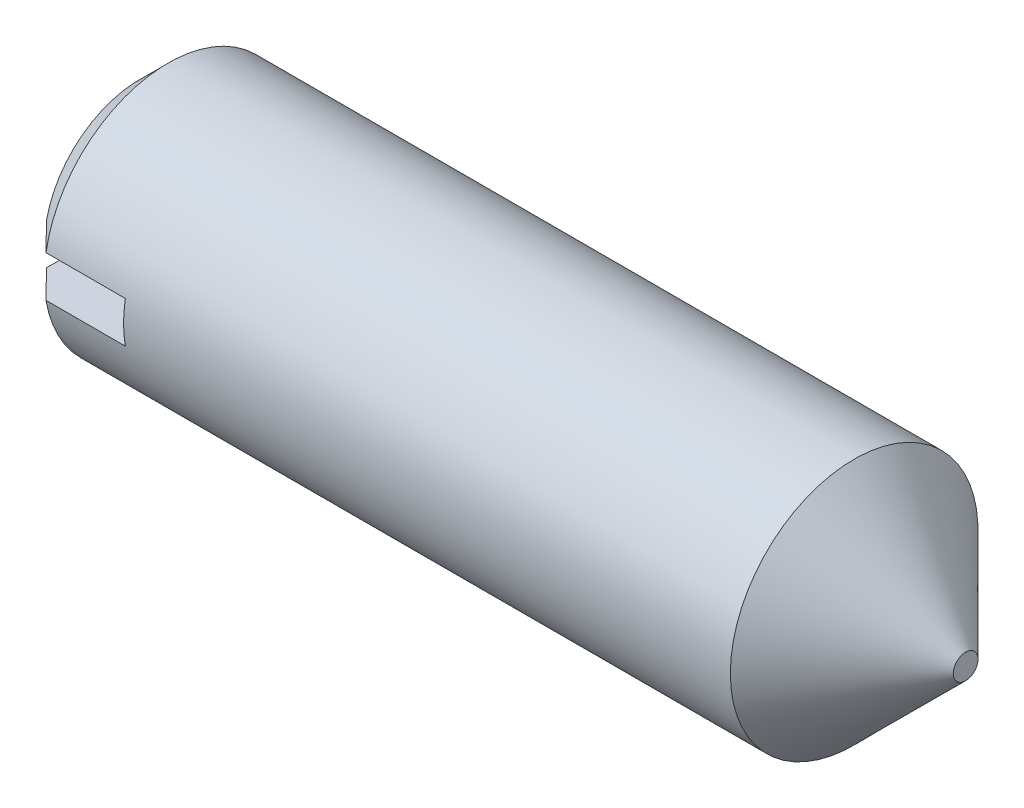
ISO-10303-21;
HEADER;
FILE_DESCRIPTION(('STEP AP214'),'2;1');
FILE_NAME('part.step','',(''),(''),'','','');
FILE_SCHEMA(('AUTOMOTIVE_DESIGN { 1 0 10303 214 1 1 1 1 }'));
ENDSEC;
DATA;
#1=APPLICATION_CONTEXT('core data for automotive mechanical design processes');
#2=APPLICATION_PROTOCOL_DEFINITION('international standard','automotive_design',2000,#1);
#3=PRODUCT_CONTEXT('',#1,'mechanical');
#4=PRODUCT('Part','Part','',(#3));
#5=PRODUCT_RELATED_PRODUCT_CATEGORY('part','',(#4));
#6=PRODUCT_DEFINITION_FORMATION('','',#4);
#7=PRODUCT_DEFINITION_CONTEXT('part definition',#1,'design');
#8=PRODUCT_DEFINITION('design','',#6,#7);
#9=PRODUCT_DEFINITION_SHAPE('','',#8);
#10=(LENGTH_UNIT() NAMED_UNIT(*) SI_UNIT(.MILLI.,.METRE.));
#11=(NAMED_UNIT(*) PLANE_ANGLE_UNIT() SI_UNIT($,.RADIAN.));
#12=(NAMED_UNIT(*) SI_UNIT($,.STERADIAN.) SOLID_ANGLE_UNIT());
#13=UNCERTAINTY_MEASURE_WITH_UNIT(LENGTH_MEASURE(1.E-05),#10,'distance_accuracy_value','');
#14=(GEOMETRIC_REPRESENTATION_CONTEXT(3) GLOBAL_UNCERTAINTY_ASSIGNED_CONTEXT((#13)) GLOBAL_UNIT_ASSIGNED_CONTEXT((#10,
#11,#12)) REPRESENTATION_CONTEXT('',''));
#15=CARTESIAN_POINT('',(0.,0.,0.));
#16=DIRECTION('',(0.,0.,1.));
#17=DIRECTION('',(1.,0.,0.));
#18=AXIS2_PLACEMENT_3D('',#15,#16,#17);
#19=CARTESIAN_POINT('',(0.,0.4645,0.));
#20=DIRECTION('',(1.,0.,0.));
#21=DIRECTION('',(0.,0.,-1.));
#22=AXIS2_PLACEMENT_3D('',#19,#20,#21);
#23=PLANE('',#22);
#24=CARTESIAN_POINT('',(0.,0.,0.));
#25=DIRECTION('',(-1.,0.,0.));
#26=DIRECTION('',(0.,0.,1.));
#27=AXIS2_PLACEMENT_3D('',#24,#25,#26);
#28=CIRCLE('',#27,0.4645);
#29=CARTESIAN_POINT('',(0.,0.1,0.453608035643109));
#30=VERTEX_POINT('',#29);
#31=CARTESIAN_POINT('',(0.,0.1,-0.453608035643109));
#32=VERTEX_POINT('',#31);
#33=EDGE_CURVE('E113',#30,#32,#28,.T.);
#34=ORIENTED_EDGE('',*,*,#33,.T.);
#35=DIRECTION('',(0.,0.,1.));
#36=VECTOR('',#35,1.);
#37=CARTESIAN_POINT('',(0.,0.1,-0.6));
#38=LINE('',#37,#36);
#39=EDGE_CURVE('E100',#32,#30,#38,.T.);
#40=ORIENTED_EDGE('',*,*,#39,.T.);
#41=EDGE_LOOP('',(#34,#40));
#42=FACE_BOUND('',#41,.T.);
#43=ADVANCED_FACE('F30',(#42),#23,.F.);
#44=CARTESIAN_POINT('',(0.1355,0.,0.));
#45=DIRECTION('',(1.,0.,0.));
#46=DIRECTION('',(0.,0.,-1.));
#47=AXIS2_PLACEMENT_3D('',#44,#45,#46);
#48=CONICAL_SURFACE('',#47,0.6,0.785398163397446);
#49=CARTESIAN_POINT('',(0.1355,0.,0.));
#50=DIRECTION('',(-1.,0.,0.));
#51=DIRECTION('',(0.,0.,1.));
#52=AXIS2_PLACEMENT_3D('',#49,#50,#51);
#53=CIRCLE('',#52,0.6);
#54=CARTESIAN_POINT('',(0.135500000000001,0.1,0.591607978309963));
#55=VERTEX_POINT('',#54);
#56=CARTESIAN_POINT('',(0.135500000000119,0.1,-0.591607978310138));
#57=VERTEX_POINT('',#56);
#58=EDGE_CURVE('E117',#55,#57,#53,.T.);
#59=ORIENTED_EDGE('',*,*,#58,.T.);
#60=CARTESIAN_POINT('',(0.860275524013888,0.1,-1.32099590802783));
#61=CARTESIAN_POINT('',(0.813630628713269,0.1,-1.27421639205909));
#62=CARTESIAN_POINT('',(0.766991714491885,0.1,-1.2274309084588));
#63=CARTESIAN_POINT('',(0.673732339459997,0.1,-1.13383826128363));
#64=CARTESIAN_POINT('',(0.627111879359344,0.1,-1.08703109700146));
#65=CARTESIAN_POINT('',(0.533858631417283,0.1,-0.993347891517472));
#66=CARTESIAN_POINT('',(0.487225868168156,0.1,-0.946471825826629));
#67=CARTESIAN_POINT('',(0.39400585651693,0.1,-0.852677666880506));
#68=CARTESIAN_POINT('',(0.347418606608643,0.1,-0.805759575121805));
#69=CARTESIAN_POINT('',(0.256319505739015,0.1,-0.713873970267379));
#70=CARTESIAN_POINT('',(0.211804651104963,0.1,-0.668909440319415));
#71=CARTESIAN_POINT('',(0.122889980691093,0.1,-0.578858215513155));
#72=CARTESIAN_POINT('',(0.0784901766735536,0.1,-0.533771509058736));
#73=CARTESIAN_POINT('',(-0.010061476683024,0.1,-0.443399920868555));
#74=CARTESIAN_POINT('',(-0.0542134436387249,0.1,-0.398115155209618));
#75=CARTESIAN_POINT('',(-0.11997613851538,0.1,-0.329746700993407));
#76=CARTESIAN_POINT('',(-0.141817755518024,0.1,-0.306885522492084));
#77=CARTESIAN_POINT('',(-0.185210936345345,0.1,-0.260890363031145));
#78=CARTESIAN_POINT('',(-0.206762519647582,0.1,-0.2377564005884));
#79=CARTESIAN_POINT('',(-0.239779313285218,0.1,-0.201318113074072));
#80=CARTESIAN_POINT('',(-0.25146751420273,0.1,-0.188217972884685));
#81=CARTESIAN_POINT('',(-0.274563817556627,0.1,-0.161615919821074));
#82=CARTESIAN_POINT('',(-0.285969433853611,0.1,-0.148111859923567));
#83=CARTESIAN_POINT('',(-0.308194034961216,0.1,-0.120431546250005));
#84=CARTESIAN_POINT('',(-0.319007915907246,0.1,-0.10625097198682));
#85=CARTESIAN_POINT('',(-0.333918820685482,0.1,-0.0841405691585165));
#86=CARTESIAN_POINT('',(-0.338659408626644,0.1,-0.0766525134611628));
#87=CARTESIAN_POINT('',(-0.347399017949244,0.1,-0.0612627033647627));
#88=CARTESIAN_POINT('',(-0.35140000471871,0.1,-0.0533621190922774));
#89=CARTESIAN_POINT('',(-0.357286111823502,0.1,-0.0390602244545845));
#90=CARTESIAN_POINT('',(-0.359450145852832,0.1,-0.0327780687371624));
#91=CARTESIAN_POINT('',(-0.362714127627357,0.1,-0.0199573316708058));
#92=CARTESIAN_POINT('',(-0.363819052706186,0.1,-0.0134201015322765));
#93=CARTESIAN_POINT('',(-0.364718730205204,0.1,-0.000185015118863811));
#94=CARTESIAN_POINT('',(-0.364500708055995,0.1,0.00651378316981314));
#95=CARTESIAN_POINT('',(-0.362781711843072,0.1,0.019753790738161));
#96=CARTESIAN_POINT('',(-0.361276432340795,0.1,0.026294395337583));
#97=CARTESIAN_POINT('',(-0.356320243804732,0.1,0.0422710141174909));
#98=CARTESIAN_POINT('',(-0.352271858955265,0.1,0.0515113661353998));
#99=CARTESIAN_POINT('',(-0.343017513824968,0.1,0.0694045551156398));
#100=CARTESIAN_POINT('',(-0.33780536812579,0.1,0.0780539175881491));
#101=CARTESIAN_POINT('',(-0.325700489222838,0.1,0.0965559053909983));
#102=CARTESIAN_POINT('',(-0.318677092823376,0.1,0.106321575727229));
#103=CARTESIAN_POINT('',(-0.304154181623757,0.1,0.125495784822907));
#104=CARTESIAN_POINT('',(-0.296654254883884,0.1,0.134904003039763));
#105=CARTESIAN_POINT('',(-0.273713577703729,0.1,0.162833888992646));
#106=CARTESIAN_POINT('',(-0.257863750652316,0.1,0.181017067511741));
#107=CARTESIAN_POINT('',(-0.225688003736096,0.1,0.217008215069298));
#108=CARTESIAN_POINT('',(-0.209361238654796,0.1,0.234815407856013));
#109=CARTESIAN_POINT('',(-0.17648614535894,0.1,0.270174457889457));
#110=CARTESIAN_POINT('',(-0.159938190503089,0.1,0.287726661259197));
#111=CARTESIAN_POINT('',(-0.110401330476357,0.1,0.33985926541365));
#112=CARTESIAN_POINT('',(-0.0772126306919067,0.1,0.374248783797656));
#113=CARTESIAN_POINT('',(-0.0106080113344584,0.1,0.44280856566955));
#114=CARTESIAN_POINT('',(0.0228079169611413,0.1,0.476978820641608));
#115=CARTESIAN_POINT('',(0.123273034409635,0.1,0.579358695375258));
#116=CARTESIAN_POINT('',(0.190498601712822,0.1,0.647395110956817));
#117=CARTESIAN_POINT('',(0.324948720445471,0.1,0.783139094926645));
#118=CARTESIAN_POINT('',(0.392172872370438,0.1,0.850847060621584));
#119=CARTESIAN_POINT('',(0.526696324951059,0.1,0.986166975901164));
#120=CARTESIAN_POINT('',(0.593995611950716,0.1,1.0537789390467));
#121=CARTESIAN_POINT('',(0.69445422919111,0.1,1.15463547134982));
#122=CARTESIAN_POINT('',(0.727596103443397,0.1,1.18789745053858));
#123=CARTESIAN_POINT('',(0.793915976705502,0.1,1.25443943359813));
#124=CARTESIAN_POINT('',(0.827093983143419,0.1,1.28771943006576));
#125=CARTESIAN_POINT('',(0.860275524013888,0.1,1.32099590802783));
#126=B_SPLINE_CURVE_WITH_KNOTS('',3,(#60,#61,#62,#63,#64,#65,#66,#67,#68,#69,#70,#71,#72,#73,
#74,#75,#76,#77,#78,#79,#80,#81,#82,#83,#84,#85,#86,#87,#88,#89,#90,#91,#92,#93,#94,#95,#96,#97,
#98,#99,#100,#101,#102,#103,#104,#105,#106,#107,#108,#109,#110,#111,#112,#113,#114,#115,#116,
#117,#118,#119,#120,#121,#122,#123,#124,#125),.UNSPECIFIED.,.F.,.F.,(4,2,2,2,2,2,2,2,2,2,2,2,2,
2,2,2,2,2,2,2,2,2,2,2,2,2,2,2,2,2,2,2,4),(0.,0.198183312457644,0.396373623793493,
0.594736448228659,0.793092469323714,0.982909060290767,1.17274434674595,1.3624802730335,
1.45733297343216,1.55217927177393,1.60484304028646,1.65786982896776,1.71129869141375,
1.73786560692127,1.76436087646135,1.78423031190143,1.80400590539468,1.82397275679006,
1.84400665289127,1.87410246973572,1.90436222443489,1.94041942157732,1.97650822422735,
2.04884773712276,2.12132432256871,2.19369104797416,2.33706610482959,2.48044669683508,
2.7673845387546,3.05362071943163,3.33981136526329,3.48067544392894,3.62165432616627),.UNSPECIFIED.);
#127=EDGE_CURVE('E53',#57,#32,#126,.T.);
#128=ORIENTED_EDGE('',*,*,#127,.T.);
#129=ORIENTED_EDGE('',*,*,#33,.F.);
#130=EDGE_CURVE('E131',#30,#55,#126,.T.);
#131=ORIENTED_EDGE('',*,*,#130,.T.);
#132=EDGE_LOOP('',(#59,#128,#129,#131));
#133=FACE_BOUND('',#132,.T.);
#134=ADVANCED_FACE('F149',(#133),#48,.T.);
#135=CARTESIAN_POINT('',(0.,-0.1,-0.453608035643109));
#136=VERTEX_POINT('',#135);
#137=CARTESIAN_POINT('',(0.,-0.1,0.453608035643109));
#138=VERTEX_POINT('',#137);
#139=EDGE_CURVE('E112',#136,#138,#28,.T.);
#140=ORIENTED_EDGE('',*,*,#139,.T.);
#141=DIRECTION('',(0.,0.,1.));
#142=VECTOR('',#141,1.);
#143=CARTESIAN_POINT('',(0.,-0.1,-0.6));
#144=LINE('',#143,#142);
#145=EDGE_CURVE('E93',#136,#138,#144,.T.);
#146=ORIENTED_EDGE('',*,*,#145,.F.);
#147=EDGE_LOOP('',(#140,#146));
#148=FACE_BOUND('',#147,.T.);
#149=ADVANCED_FACE('F32',(#148),#23,.F.);
#150=CARTESIAN_POINT('',(4.,0.,0.));
#151=DIRECTION('',(-1.,0.,0.));
#152=DIRECTION('',(0.,0.,1.));
#153=AXIS2_PLACEMENT_3D('',#150,#151,#152);
#154=PLANE('',#153);
#155=CARTESIAN_POINT('',(4.,0.,0.));
#156=DIRECTION('',(-1.,0.,0.));
#157=DIRECTION('',(0.,0.,1.));
#158=AXIS2_PLACEMENT_3D('',#155,#156,#157);
#159=CIRCLE('',#158,0.06);
#160=CARTESIAN_POINT('',(4.,0.,0.0599999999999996));
#161=VERTEX_POINT('',#160);
#162=EDGE_CURVE('E121',#161,#161,#159,.T.);
#163=ORIENTED_EDGE('',*,*,#162,.F.);
#164=EDGE_LOOP('',(#163));
#165=FACE_BOUND('',#164,.T.);
#166=ADVANCED_FACE('F156',(#165),#154,.F.);
#167=CARTESIAN_POINT('',(4.,0.,0.));
#168=DIRECTION('',(-1.,0.,0.));
#169=DIRECTION('',(0.,0.,1.));
#170=AXIS2_PLACEMENT_3D('',#167,#168,#169);
#171=CONICAL_SURFACE('',#170,0.06,0.785398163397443);
#172=CARTESIAN_POINT('',(3.45999999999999,0.,0.));
#173=DIRECTION('',(-1.,0.,0.));
#174=DIRECTION('',(0.,0.,1.));
#175=AXIS2_PLACEMENT_3D('',#172,#173,#174);
#176=CIRCLE('',#175,0.6);
#177=CARTESIAN_POINT('',(3.45999999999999,0.,0.6));
#178=VERTEX_POINT('',#177);
#179=EDGE_CURVE('E118',#178,#178,#176,.T.);
#180=CARTESIAN_POINT('',(3.45999999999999,0.,0.6));
#181=CARTESIAN_POINT('',(3.46562499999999,0.,0.594375));
#182=CARTESIAN_POINT('',(3.47124999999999,0.,0.58875));
#183=CARTESIAN_POINT('',(3.48249999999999,0.,0.5775));
#184=CARTESIAN_POINT('',(3.48812499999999,0.,0.571875));
#185=CARTESIAN_POINT('',(3.49937499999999,0.,0.560625));
#186=CARTESIAN_POINT('',(3.50499999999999,0.,0.555));
#187=CARTESIAN_POINT('',(3.51624999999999,0.,0.54375));
#188=CARTESIAN_POINT('',(3.52187499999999,0.,0.538125));
#189=CARTESIAN_POINT('',(3.53312499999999,0.,0.526875));
#190=CARTESIAN_POINT('',(3.53874999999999,0.,0.52125));
#191=CARTESIAN_POINT('',(3.54999999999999,0.,0.51));
#192=CARTESIAN_POINT('',(3.55562499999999,0.,0.504375));
#193=CARTESIAN_POINT('',(3.56687499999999,0.,0.493125));
#194=CARTESIAN_POINT('',(3.57249999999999,0.,0.4875));
#195=CARTESIAN_POINT('',(3.58374999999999,0.,0.47625));
#196=CARTESIAN_POINT('',(3.58937499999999,0.,0.470625));
#197=CARTESIAN_POINT('',(3.60062499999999,0.,0.459375));
#198=CARTESIAN_POINT('',(3.60624999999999,0.,0.45375));
#199=CARTESIAN_POINT('',(3.61749999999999,0.,0.4425));
#200=CARTESIAN_POINT('',(3.623125,0.,0.436875));
#201=CARTESIAN_POINT('',(3.634375,0.,0.425625));
#202=CARTESIAN_POINT('',(3.63999999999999,0.,0.42));
#203=CARTESIAN_POINT('',(3.65124999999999,0.,0.40875));
#204=CARTESIAN_POINT('',(3.65687499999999,0.,0.403125));
#205=CARTESIAN_POINT('',(3.66812499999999,0.,0.391875));
#206=CARTESIAN_POINT('',(3.67375,0.,0.38625));
#207=CARTESIAN_POINT('',(3.685,0.,0.375));
#208=CARTESIAN_POINT('',(3.690625,0.,0.369375));
#209=CARTESIAN_POINT('',(3.701875,0.,0.358125));
#210=CARTESIAN_POINT('',(3.7075,0.,0.3525));
#211=CARTESIAN_POINT('',(3.71875,0.,0.34125));
#212=CARTESIAN_POINT('',(3.724375,0.,0.335625));
#213=CARTESIAN_POINT('',(3.735625,0.,0.324375));
#214=CARTESIAN_POINT('',(3.74125,0.,0.31875));
#215=CARTESIAN_POINT('',(3.7525,0.,0.3075));
#216=CARTESIAN_POINT('',(3.758125,0.,0.301875));
#217=CARTESIAN_POINT('',(3.769375,0.,0.290625));
#218=CARTESIAN_POINT('',(3.775,0.,0.285));
#219=CARTESIAN_POINT('',(3.78625,0.,0.27375));
#220=CARTESIAN_POINT('',(3.791875,0.,0.268125));
#221=CARTESIAN_POINT('',(3.803125,0.,0.256875));
#222=CARTESIAN_POINT('',(3.80875,0.,0.25125));
#223=CARTESIAN_POINT('',(3.82,0.,0.239999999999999));
#224=CARTESIAN_POINT('',(3.825625,0.,0.234375));
#225=CARTESIAN_POINT('',(3.836875,0.,0.223125));
#226=CARTESIAN_POINT('',(3.8425,0.,0.2175));
#227=CARTESIAN_POINT('',(3.85375,0.,0.20625));
#228=CARTESIAN_POINT('',(3.859375,0.,0.200625));
#229=CARTESIAN_POINT('',(3.870625,0.,0.189375));
#230=CARTESIAN_POINT('',(3.87625,0.,0.18375));
#231=CARTESIAN_POINT('',(3.8875,0.,0.1725));
#232=CARTESIAN_POINT('',(3.893125,0.,0.166875));
#233=CARTESIAN_POINT('',(3.904375,0.,0.155625));
#234=CARTESIAN_POINT('',(3.91,0.,0.15));
#235=CARTESIAN_POINT('',(3.92125,0.,0.13875));
#236=CARTESIAN_POINT('',(3.926875,0.,0.133125));
#237=CARTESIAN_POINT('',(3.938125,0.,0.121875));
#238=CARTESIAN_POINT('',(3.94375,0.,0.11625));
#239=CARTESIAN_POINT('',(3.955,0.,0.104999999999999));
#240=CARTESIAN_POINT('',(3.960625,0.,0.0993749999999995));
#241=CARTESIAN_POINT('',(3.971875,0.,0.0881249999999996));
#242=CARTESIAN_POINT('',(3.9775,0.,0.0824999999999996));
#243=CARTESIAN_POINT('',(3.98875,0.,0.0712499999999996));
#244=CARTESIAN_POINT('',(3.994375,0.,0.0656249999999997));
#245=CARTESIAN_POINT('',(4.,0.,0.0599999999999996));
#246=B_SPLINE_CURVE_WITH_KNOTS('',3,(#180,#181,#182,#183,#184,#185,#186,#187,#188,#189,#190,
#191,#192,#193,#194,#195,#196,#197,#198,#199,#200,#201,#202,#203,#204,#205,#206,#207,#208,#209,
#210,#211,#212,#213,#214,#215,#216,#217,#218,#219,#220,#221,#222,#223,#224,#225,#226,#227,#228,
#229,#230,#231,#232,#233,#234,#235,#236,#237,#238,#239,#240,#241,#242,#243,#244,#245),
.UNSPECIFIED.,.F.,.F.,(4,2,2,2,2,2,2,2,2,2,2,2,2,2,2,2,2,2,2,2,2,2,2,2,2,2,2,2,2,2,2,2,4),(0.,
0.0238648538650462,0.0477297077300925,0.0715945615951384,0.0954594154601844,0.119324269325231,
0.143189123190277,0.167053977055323,0.190918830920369,0.214783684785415,0.238648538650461,
0.262513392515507,0.286378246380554,0.310243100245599,0.334107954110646,0.357972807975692,
0.381837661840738,0.405702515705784,0.42956736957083,0.453432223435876,0.477297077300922,
0.501161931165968,0.525026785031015,0.548891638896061,0.572756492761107,0.596621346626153,
0.620486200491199,0.644351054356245,0.668215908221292,0.692080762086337,0.715945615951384,
0.73981046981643,0.763675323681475),.UNSPECIFIED.);
#247=EDGE_CURVE('BSEAM161',#178,#161,#246,.T.);
#248=ORIENTED_EDGE('',*,*,#179,.F.);
#249=ORIENTED_EDGE('',*,*,#162,.T.);
#250=ORIENTED_EDGE('',*,*,#247,.T.);
#251=ORIENTED_EDGE('',*,*,#247,.F.);
#252=EDGE_LOOP('',(#248,#250,#249,#251));
#253=FACE_BOUND('',#252,.T.);
#254=ADVANCED_FACE('F161',(#253),#171,.T.);
#255=CARTESIAN_POINT('',(-14.774129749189,0.,0.));
#256=DIRECTION('',(-1.,0.,0.));
#257=DIRECTION('',(0.,0.,1.));
#258=AXIS2_PLACEMENT_3D('',#255,#256,#257);
#259=CYLINDRICAL_SURFACE('',#258,0.6);
#260=CARTESIAN_POINT('',(0.52,0.,0.));
#261=DIRECTION('',(1.,0.,0.));
#262=DIRECTION('',(0.,0.,-1.));
#263=AXIS2_PLACEMENT_3D('',#260,#261,#262);
#264=CIRCLE('',#263,0.6);
#265=CARTESIAN_POINT('',(0.52,-0.1,-0.591607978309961));
#266=VERTEX_POINT('',#265);
#267=CARTESIAN_POINT('',(0.52,0.1,-0.591607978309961));
#268=VERTEX_POINT('',#267);
#269=EDGE_CURVE('E11',#266,#268,#264,.T.);
#270=ORIENTED_EDGE('',*,*,#269,.T.);
#271=DIRECTION('',(-1.,0.,0.));
#272=VECTOR('',#271,1.);
#273=CARTESIAN_POINT('',(-14.774129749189,0.1,-0.591607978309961));
#274=LINE('',#273,#272);
#275=EDGE_CURVE('E110',#268,#57,#274,.T.);
#276=ORIENTED_EDGE('',*,*,#275,.T.);
#277=ORIENTED_EDGE('',*,*,#58,.F.);
#278=DIRECTION('',(-1.,0.,0.));
#279=VECTOR('',#278,1.);
#280=CARTESIAN_POINT('',(-14.774129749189,0.1,0.591607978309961));
#281=LINE('',#280,#279);
#282=CARTESIAN_POINT('',(0.52,0.1,0.591607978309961));
#283=VERTEX_POINT('',#282);
#284=EDGE_CURVE('E102',#55,#283,#281,.F.);
#285=ORIENTED_EDGE('',*,*,#284,.T.);
#286=CARTESIAN_POINT('',(0.52,-0.1,0.591607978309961));
#287=VERTEX_POINT('',#286);
#288=EDGE_CURVE('E34',#283,#287,#264,.T.);
#289=ORIENTED_EDGE('',*,*,#288,.T.);
#290=DIRECTION('',(-1.,0.,0.));
#291=VECTOR('',#290,1.);
#292=CARTESIAN_POINT('',(-14.774129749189,-0.1,0.591607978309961));
#293=LINE('',#292,#291);
#294=CARTESIAN_POINT('',(0.135500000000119,-0.1,0.591607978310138));
#295=VERTEX_POINT('',#294);
#296=EDGE_CURVE('E92',#287,#295,#293,.T.);
#297=ORIENTED_EDGE('',*,*,#296,.T.);
#298=CARTESIAN_POINT('',(0.1355,-0.1,-0.591607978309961));
#299=VERTEX_POINT('',#298);
#300=EDGE_CURVE('E99',#299,#295,#53,.T.);
#301=ORIENTED_EDGE('',*,*,#300,.F.);
#302=DIRECTION('',(-1.,0.,0.));
#303=VECTOR('',#302,1.);
#304=CARTESIAN_POINT('',(-14.774129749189,-0.1,-0.591607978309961));
#305=LINE('',#304,#303);
#306=EDGE_CURVE('E45',#299,#266,#305,.F.);
#307=ORIENTED_EDGE('',*,*,#306,.T.);
#308=EDGE_LOOP('',(#270,#276,#277,#285,#289,#297,#301,#307));
#309=FACE_BOUND('',#308,.T.);
#310=ORIENTED_EDGE('',*,*,#179,.T.);
#311=EDGE_LOOP('',(#310));
#312=FACE_BOUND('',#311,.T.);
#313=ADVANCED_FACE('F96',(#309,#312),#259,.T.);
#314=ORIENTED_EDGE('',*,*,#300,.T.);
#315=CARTESIAN_POINT('',(0.860275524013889,-0.1,1.32099590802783));
#316=CARTESIAN_POINT('',(0.813630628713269,-0.1,1.27421639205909));
#317=CARTESIAN_POINT('',(0.766991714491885,-0.1,1.2274309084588));
#318=CARTESIAN_POINT('',(0.673732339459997,-0.1,1.13383826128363));
#319=CARTESIAN_POINT('',(0.627111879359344,-0.1,1.08703109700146));
#320=CARTESIAN_POINT('',(0.533858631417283,-0.1,0.993347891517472));
#321=CARTESIAN_POINT('',(0.487225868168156,-0.1,0.94647182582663));
#322=CARTESIAN_POINT('',(0.39400585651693,-0.1,0.852677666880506));
#323=CARTESIAN_POINT('',(0.347418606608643,-0.1,0.805759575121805));
#324=CARTESIAN_POINT('',(0.256319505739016,-0.1,0.713873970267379));
#325=CARTESIAN_POINT('',(0.211804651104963,-0.1,0.668909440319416));
#326=CARTESIAN_POINT('',(0.122889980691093,-0.1,0.578858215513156));
#327=CARTESIAN_POINT('',(0.078490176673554,-0.1,0.533771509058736));
#328=CARTESIAN_POINT('',(-0.0100614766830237,-0.1,0.443399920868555));
#329=CARTESIAN_POINT('',(-0.0542134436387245,-0.1,0.398115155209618));
#330=CARTESIAN_POINT('',(-0.11997613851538,-0.1,0.329746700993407));
#331=CARTESIAN_POINT('',(-0.141817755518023,-0.1,0.306885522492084));
#332=CARTESIAN_POINT('',(-0.185210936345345,-0.1,0.260890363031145));
#333=CARTESIAN_POINT('',(-0.206762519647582,-0.1,0.2377564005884));
#334=CARTESIAN_POINT('',(-0.239779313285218,-0.1,0.201318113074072));
#335=CARTESIAN_POINT('',(-0.25146751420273,-0.1,0.188217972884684));
#336=CARTESIAN_POINT('',(-0.274563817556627,-0.1,0.161615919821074));
#337=CARTESIAN_POINT('',(-0.285969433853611,-0.1,0.148111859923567));
#338=CARTESIAN_POINT('',(-0.308194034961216,-0.1,0.120431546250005));
#339=CARTESIAN_POINT('',(-0.319007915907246,-0.1,0.10625097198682));
#340=CARTESIAN_POINT('',(-0.333918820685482,-0.1,0.0841405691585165));
#341=CARTESIAN_POINT('',(-0.338659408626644,-0.1,0.0766525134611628));
#342=CARTESIAN_POINT('',(-0.347399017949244,-0.1,0.0612627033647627));
#343=CARTESIAN_POINT('',(-0.35140000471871,-0.1,0.0533621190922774));
#344=CARTESIAN_POINT('',(-0.357286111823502,-0.1,0.0390602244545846));
#345=CARTESIAN_POINT('',(-0.359450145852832,-0.1,0.0327780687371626));
#346=CARTESIAN_POINT('',(-0.362714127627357,-0.1,0.019957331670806));
#347=CARTESIAN_POINT('',(-0.363819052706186,-0.1,0.0134201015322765));
#348=CARTESIAN_POINT('',(-0.364718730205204,-0.1,0.000185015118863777));
#349=CARTESIAN_POINT('',(-0.364500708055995,-0.1,-0.00651378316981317));
#350=CARTESIAN_POINT('',(-0.362781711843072,-0.1,-0.019753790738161));
#351=CARTESIAN_POINT('',(-0.361276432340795,-0.1,-0.0262943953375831));
#352=CARTESIAN_POINT('',(-0.356320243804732,-0.1,-0.0422710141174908));
#353=CARTESIAN_POINT('',(-0.352271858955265,-0.1,-0.0515113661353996));
#354=CARTESIAN_POINT('',(-0.343017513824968,-0.1,-0.0694045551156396));
#355=CARTESIAN_POINT('',(-0.33780536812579,-0.1,-0.078053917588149));
#356=CARTESIAN_POINT('',(-0.325700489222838,-0.1,-0.0965559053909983));
#357=CARTESIAN_POINT('',(-0.318677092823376,-0.1,-0.106321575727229));
#358=CARTESIAN_POINT('',(-0.304154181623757,-0.1,-0.125495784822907));
#359=CARTESIAN_POINT('',(-0.296654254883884,-0.1,-0.134904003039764));
#360=CARTESIAN_POINT('',(-0.273713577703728,-0.1,-0.162833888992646));
#361=CARTESIAN_POINT('',(-0.257863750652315,-0.1,-0.181017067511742));
#362=CARTESIAN_POINT('',(-0.225688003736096,-0.1,-0.217008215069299));
#363=CARTESIAN_POINT('',(-0.209361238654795,-0.1,-0.234815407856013));
#364=CARTESIAN_POINT('',(-0.17648614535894,-0.1,-0.270174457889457));
#365=CARTESIAN_POINT('',(-0.159938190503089,-0.1,-0.287726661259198));
#366=CARTESIAN_POINT('',(-0.110401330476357,-0.1,-0.339859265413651));
#367=CARTESIAN_POINT('',(-0.0772126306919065,-0.1,-0.374248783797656));
#368=CARTESIAN_POINT('',(-0.0106080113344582,-0.1,-0.44280856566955));
#369=CARTESIAN_POINT('',(0.0228079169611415,-0.1,-0.476978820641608));
#370=CARTESIAN_POINT('',(0.123273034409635,-0.1,-0.579358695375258));
#371=CARTESIAN_POINT('',(0.190498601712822,-0.1,-0.647395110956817));
#372=CARTESIAN_POINT('',(0.324948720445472,-0.1,-0.783139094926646));
#373=CARTESIAN_POINT('',(0.392172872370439,-0.1,-0.850847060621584));
#374=CARTESIAN_POINT('',(0.52669632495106,-0.1,-0.986166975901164));
#375=CARTESIAN_POINT('',(0.593995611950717,-0.1,-1.0537789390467));
#376=CARTESIAN_POINT('',(0.69445422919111,-0.1,-1.15463547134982));
#377=CARTESIAN_POINT('',(0.727596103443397,-0.1,-1.18789745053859));
#378=CARTESIAN_POINT('',(0.793915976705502,-0.1,-1.25443943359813));
#379=CARTESIAN_POINT('',(0.827093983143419,-0.1,-1.28771943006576));
#380=CARTESIAN_POINT('',(0.860275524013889,-0.1,-1.32099590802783));
#381=B_SPLINE_CURVE_WITH_KNOTS('',3,(#315,#316,#317,#318,#319,#320,#321,#322,#323,#324,#325,
#326,#327,#328,#329,#330,#331,#332,#333,#334,#335,#336,#337,#338,#339,#340,#341,#342,#343,#344,
#345,#346,#347,#348,#349,#350,#351,#352,#353,#354,#355,#356,#357,#358,#359,#360,#361,#362,#363,
#364,#365,#366,#367,#368,#369,#370,#371,#372,#373,#374,#375,#376,#377,#378,#379,#380),
.UNSPECIFIED.,.F.,.F.,(4,2,2,2,2,2,2,2,2,2,2,2,2,2,2,2,2,2,2,2,2,2,2,2,2,2,2,2,2,2,2,2,4),(0.,
0.198183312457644,0.396373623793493,0.594736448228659,0.793092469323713,0.982909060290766,
1.17274434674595,1.3624802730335,1.45733297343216,1.55217927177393,1.60484304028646,
1.65786982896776,1.71129869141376,1.73786560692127,1.76436087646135,1.78423031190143,
1.80400590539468,1.82397275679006,1.84400665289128,1.87410246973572,1.90436222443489,
1.94041942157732,1.97650822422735,2.04884773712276,2.12132432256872,2.19369104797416,
2.33706610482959,2.48044669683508,2.7673845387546,3.05362071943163,3.33981136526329,
3.48067544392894,3.62165432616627),.UNSPECIFIED.);
#382=EDGE_CURVE('E130',#295,#138,#381,.T.);
#383=ORIENTED_EDGE('',*,*,#382,.T.);
#384=ORIENTED_EDGE('',*,*,#139,.F.);
#385=EDGE_CURVE('E124',#136,#299,#381,.T.);
#386=ORIENTED_EDGE('',*,*,#385,.T.);
#387=EDGE_LOOP('',(#314,#383,#384,#386));
#388=FACE_BOUND('',#387,.T.);
#389=ADVANCED_FACE('F136',(#388),#48,.T.);
#390=CARTESIAN_POINT('',(0.52,0.1,-0.6));
#391=DIRECTION('',(1.,0.,0.));
#392=DIRECTION('',(0.,0.,-1.));
#393=AXIS2_PLACEMENT_3D('',#390,#391,#392);
#394=PLANE('',#393);
#395=DIRECTION('',(0.,0.,1.));
#396=VECTOR('',#395,1.);
#397=CARTESIAN_POINT('',(0.52,0.1,-0.6));
#398=LINE('',#397,#396);
#399=EDGE_CURVE('E88',#268,#283,#398,.T.);
#400=ORIENTED_EDGE('',*,*,#399,.F.);
#401=ORIENTED_EDGE('',*,*,#269,.F.);
#402=DIRECTION('',(0.,0.,1.));
#403=VECTOR('',#402,1.);
#404=CARTESIAN_POINT('',(0.52,-0.1,-0.6));
#405=LINE('',#404,#403);
#406=EDGE_CURVE('E85',#266,#287,#405,.T.);
#407=ORIENTED_EDGE('',*,*,#406,.T.);
#408=ORIENTED_EDGE('',*,*,#288,.F.);
#409=EDGE_LOOP('',(#400,#401,#407,#408));
#410=FACE_BOUND('',#409,.T.);
#411=ADVANCED_FACE('F84',(#410),#394,.F.);
#412=CARTESIAN_POINT('',(0.,0.1,-0.6));
#413=DIRECTION('',(0.,1.,0.));
#414=DIRECTION('',(0.,0.,1.));
#415=AXIS2_PLACEMENT_3D('',#412,#413,#414);
#416=PLANE('',#415);
#417=ORIENTED_EDGE('',*,*,#399,.T.);
#418=ORIENTED_EDGE('',*,*,#284,.F.);
#419=ORIENTED_EDGE('',*,*,#130,.F.);
#420=ORIENTED_EDGE('',*,*,#39,.F.);
#421=ORIENTED_EDGE('',*,*,#127,.F.);
#422=ORIENTED_EDGE('',*,*,#275,.F.);
#423=EDGE_LOOP('',(#417,#418,#419,#420,#421,#422));
#424=FACE_BOUND('',#423,.T.);
#425=ADVANCED_FACE('F142',(#424),#416,.F.);
#426=CARTESIAN_POINT('',(0.,-0.1,-0.6));
#427=DIRECTION('',(0.,-1.,0.));
#428=DIRECTION('',(1.,0.,0.));
#429=AXIS2_PLACEMENT_3D('',#426,#427,#428);
#430=PLANE('',#429);
#431=ORIENTED_EDGE('',*,*,#406,.F.);
#432=ORIENTED_EDGE('',*,*,#306,.F.);
#433=ORIENTED_EDGE('',*,*,#385,.F.);
#434=ORIENTED_EDGE('',*,*,#145,.T.);
#435=ORIENTED_EDGE('',*,*,#382,.F.);
#436=ORIENTED_EDGE('',*,*,#296,.F.);
#437=EDGE_LOOP('',(#431,#432,#433,#434,#435,#436));
#438=FACE_BOUND('',#437,.T.);
#439=ADVANCED_FACE('F90',(#438),#430,.F.);
#440=CLOSED_SHELL('',(#43,#134,#149,#166,#254,#313,#389,#411,#425,#439));
#441=MANIFOLD_SOLID_BREP('B2',#440);
#442=ADVANCED_BREP_SHAPE_REPRESENTATION('',(#18,#441),#14);
#443=SHAPE_DEFINITION_REPRESENTATION(#9,#442);
ENDSEC;
END-ISO-10303-21;
